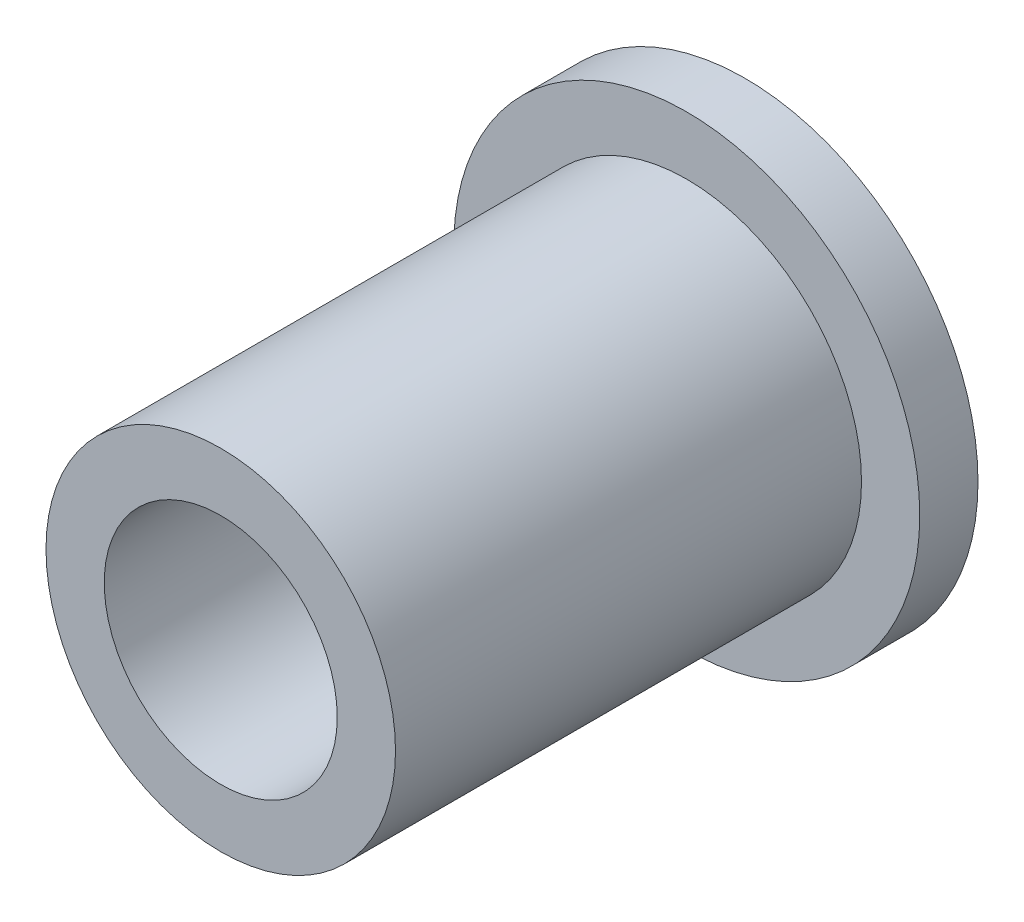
from build123d import *

# Parameters (mm, degrees)
SKETCH1_R           = 6.35
BOSS_EXTRUDE1_DEPTH = 1.5875
SKETCH2_R           = 4.7625
BOSS_EXTRUDE2_DEPTH = 12.7
SKETCH3_R           = 3.175
CUT_EXTRUDE1_DEPTH  = 17.875356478


with BuildPart() as part:
    # Sketch1 → Boss-Extrude1 (new body)
    with BuildSketch(Plane.XY):
        Circle(SKETCH1_R)
    extrude(amount=BOSS_EXTRUDE1_DEPTH)

    # Sketch2 → Boss-Extrude2 (add)
    with BuildSketch(Plane.XY.offset(1.5875)):
        Circle(SKETCH2_R)
    extrude(amount=BOSS_EXTRUDE2_DEPTH)

    # Sketch3 → Cut-Extrude1 (cut, through all)
    with BuildSketch(Plane.XY.offset(14.2875)):
        Circle(SKETCH3_R)
    extrude(amount=-CUT_EXTRUDE1_DEPTH, mode=Mode.SUBTRACT)


solid = part.part
